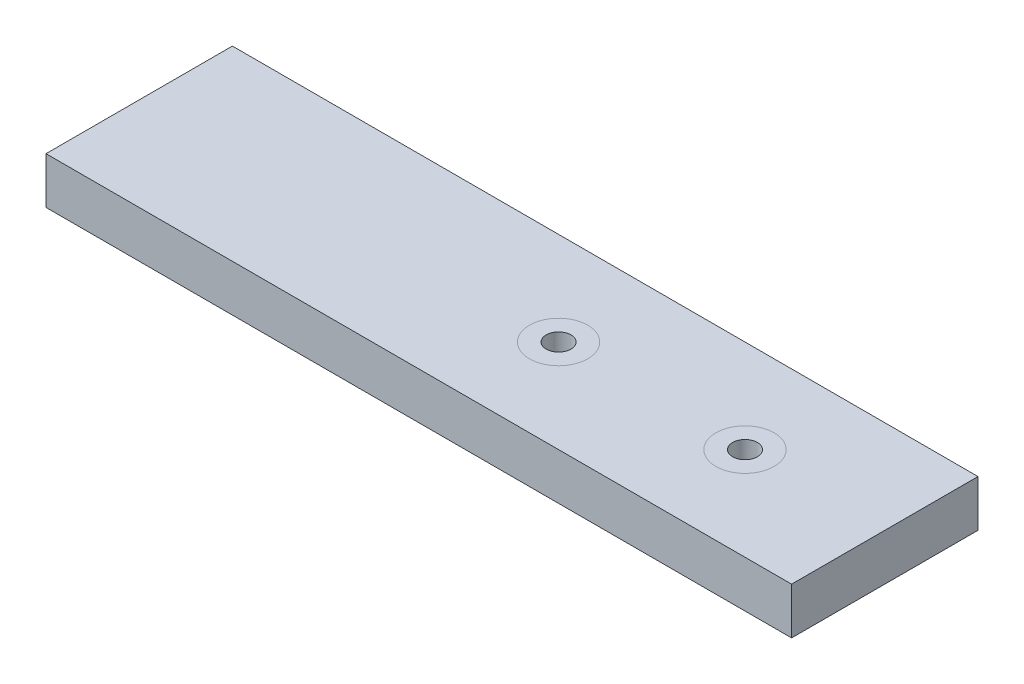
ISO-10303-21;
HEADER;
FILE_DESCRIPTION(('STEP AP214'),'2;1');
FILE_NAME('part.step','',(''),(''),'','','');
FILE_SCHEMA(('AUTOMOTIVE_DESIGN { 1 0 10303 214 1 1 1 1 }'));
ENDSEC;
DATA;
#1=APPLICATION_CONTEXT('core data for automotive mechanical design processes');
#2=APPLICATION_PROTOCOL_DEFINITION('international standard','automotive_design',2000,#1);
#3=PRODUCT_CONTEXT('',#1,'mechanical');
#4=PRODUCT('Part','Part','',(#3));
#5=PRODUCT_RELATED_PRODUCT_CATEGORY('part','',(#4));
#6=PRODUCT_DEFINITION_FORMATION('','',#4);
#7=PRODUCT_DEFINITION_CONTEXT('part definition',#1,'design');
#8=PRODUCT_DEFINITION('design','',#6,#7);
#9=PRODUCT_DEFINITION_SHAPE('','',#8);
#10=(LENGTH_UNIT() NAMED_UNIT(*) SI_UNIT(.MILLI.,.METRE.));
#11=(NAMED_UNIT(*) PLANE_ANGLE_UNIT() SI_UNIT($,.RADIAN.));
#12=(NAMED_UNIT(*) SI_UNIT($,.STERADIAN.) SOLID_ANGLE_UNIT());
#13=UNCERTAINTY_MEASURE_WITH_UNIT(LENGTH_MEASURE(1.E-05),#10,'distance_accuracy_value','');
#14=(GEOMETRIC_REPRESENTATION_CONTEXT(3) GLOBAL_UNCERTAINTY_ASSIGNED_CONTEXT((#13)) GLOBAL_UNIT_ASSIGNED_CONTEXT((#10,
#11,#12)) REPRESENTATION_CONTEXT('',''));
#15=CARTESIAN_POINT('',(0.,0.,0.));
#16=DIRECTION('',(0.,0.,1.));
#17=DIRECTION('',(1.,0.,0.));
#18=AXIS2_PLACEMENT_3D('',#15,#16,#17);
#19=CARTESIAN_POINT('',(0.,0.,-25.4));
#20=DIRECTION('',(0.,-1.,0.));
#21=DIRECTION('',(0.,0.,-1.));
#22=AXIS2_PLACEMENT_3D('',#19,#20,#21);
#23=PLANE('',#22);
#24=CARTESIAN_POINT('',(114.3,0.,0.));
#25=DIRECTION('',(0.,-1.,0.));
#26=DIRECTION('',(0.,0.,-1.));
#27=AXIS2_PLACEMENT_3D('',#24,#25,#26);
#28=CIRCLE('',#27,7.93749999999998);
#29=CARTESIAN_POINT('',(114.3,0.,-7.93749999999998));
#30=VERTEX_POINT('',#29);
#31=EDGE_CURVE('E117',#30,#30,#28,.F.);
#32=ORIENTED_EDGE('',*,*,#31,.T.);
#33=EDGE_LOOP('',(#32));
#34=FACE_BOUND('',#33,.T.);
#35=DIRECTION('',(0.,0.,1.));
#36=VECTOR('',#35,1.);
#37=CARTESIAN_POINT('',(0.,0.,25.4));
#38=LINE('',#37,#36);
#39=CARTESIAN_POINT('',(0.,0.,-25.4));
#40=VERTEX_POINT('',#39);
#41=CARTESIAN_POINT('',(0.,0.,25.4));
#42=VERTEX_POINT('',#41);
#43=EDGE_CURVE('E103',#40,#42,#38,.T.);
#44=ORIENTED_EDGE('',*,*,#43,.F.);
#45=DIRECTION('',(-1.,0.,0.));
#46=VECTOR('',#45,1.);
#47=CARTESIAN_POINT('',(0.,0.,-25.4));
#48=LINE('',#47,#46);
#49=CARTESIAN_POINT('',(203.2,0.,-25.4));
#50=VERTEX_POINT('',#49);
#51=EDGE_CURVE('E74',#50,#40,#48,.T.);
#52=ORIENTED_EDGE('',*,*,#51,.F.);
#53=DIRECTION('',(0.,0.,-1.));
#54=VECTOR('',#53,1.);
#55=CARTESIAN_POINT('',(203.2,0.,25.4));
#56=LINE('',#55,#54);
#57=CARTESIAN_POINT('',(203.2,0.,25.4));
#58=VERTEX_POINT('',#57);
#59=EDGE_CURVE('E68',#58,#50,#56,.T.);
#60=ORIENTED_EDGE('',*,*,#59,.F.);
#61=DIRECTION('',(1.,0.,0.));
#62=VECTOR('',#61,1.);
#63=CARTESIAN_POINT('',(0.,0.,25.4));
#64=LINE('',#63,#62);
#65=EDGE_CURVE('E93',#42,#58,#64,.T.);
#66=ORIENTED_EDGE('',*,*,#65,.F.);
#67=EDGE_LOOP('',(#44,#52,#60,#66));
#68=FACE_BOUND('',#67,.T.);
#69=CARTESIAN_POINT('',(165.1,0.,0.));
#70=DIRECTION('',(0.,-1.,0.));
#71=DIRECTION('',(0.,0.,-1.));
#72=AXIS2_PLACEMENT_3D('',#69,#70,#71);
#73=CIRCLE('',#72,7.93749999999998);
#74=CARTESIAN_POINT('',(165.1,0.,-7.93749999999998));
#75=VERTEX_POINT('',#74);
#76=EDGE_CURVE('E11',#75,#75,#73,.F.);
#77=ORIENTED_EDGE('',*,*,#76,.T.);
#78=EDGE_LOOP('',(#77));
#79=FACE_BOUND('',#78,.T.);
#80=ADVANCED_FACE('F33',(#34,#68,#79),#23,.T.);
#81=CARTESIAN_POINT('',(0.,12.7,-25.4));
#82=DIRECTION('',(0.,-1.,0.));
#83=DIRECTION('',(0.,0.,-1.));
#84=AXIS2_PLACEMENT_3D('',#81,#82,#83);
#85=PLANE('',#84);
#86=CARTESIAN_POINT('',(114.3,12.7,0.));
#87=DIRECTION('',(0.,-1.,0.));
#88=DIRECTION('',(0.,0.,-1.));
#89=AXIS2_PLACEMENT_3D('',#86,#87,#88);
#90=CIRCLE('',#89,7.93749999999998);
#91=CARTESIAN_POINT('',(114.3,12.7,-7.93749999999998));
#92=VERTEX_POINT('',#91);
#93=EDGE_CURVE('E113',#92,#92,#90,.F.);
#94=ORIENTED_EDGE('',*,*,#93,.F.);
#95=EDGE_LOOP('',(#94));
#96=FACE_BOUND('',#95,.T.);
#97=DIRECTION('',(0.,0.,1.));
#98=VECTOR('',#97,1.);
#99=CARTESIAN_POINT('',(0.,12.7,25.4));
#100=LINE('',#99,#98);
#101=CARTESIAN_POINT('',(0.,12.7,-25.4));
#102=VERTEX_POINT('',#101);
#103=CARTESIAN_POINT('',(0.,12.7,25.4));
#104=VERTEX_POINT('',#103);
#105=EDGE_CURVE('E88',#102,#104,#100,.T.);
#106=ORIENTED_EDGE('',*,*,#105,.T.);
#107=DIRECTION('',(1.,0.,0.));
#108=VECTOR('',#107,1.);
#109=CARTESIAN_POINT('',(0.,12.7,25.4));
#110=LINE('',#109,#108);
#111=CARTESIAN_POINT('',(203.2,12.7,25.4));
#112=VERTEX_POINT('',#111);
#113=EDGE_CURVE('E82',#104,#112,#110,.T.);
#114=ORIENTED_EDGE('',*,*,#113,.T.);
#115=DIRECTION('',(0.,0.,-1.));
#116=VECTOR('',#115,1.);
#117=CARTESIAN_POINT('',(203.2,12.7,25.4));
#118=LINE('',#117,#116);
#119=CARTESIAN_POINT('',(203.2,12.7,-25.4));
#120=VERTEX_POINT('',#119);
#121=EDGE_CURVE('E86',#112,#120,#118,.T.);
#122=ORIENTED_EDGE('',*,*,#121,.T.);
#123=DIRECTION('',(-1.,0.,0.));
#124=VECTOR('',#123,1.);
#125=CARTESIAN_POINT('',(0.,12.7,-25.4));
#126=LINE('',#125,#124);
#127=EDGE_CURVE('E51',#120,#102,#126,.T.);
#128=ORIENTED_EDGE('',*,*,#127,.T.);
#129=EDGE_LOOP('',(#106,#114,#122,#128));
#130=FACE_BOUND('',#129,.T.);
#131=CARTESIAN_POINT('',(165.1,12.7,0.));
#132=DIRECTION('',(0.,-1.,0.));
#133=DIRECTION('',(0.,0.,-1.));
#134=AXIS2_PLACEMENT_3D('',#131,#132,#133);
#135=CIRCLE('',#134,7.93749999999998);
#136=CARTESIAN_POINT('',(165.1,12.7,-7.93749999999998));
#137=VERTEX_POINT('',#136);
#138=EDGE_CURVE('E43',#137,#137,#135,.F.);
#139=ORIENTED_EDGE('',*,*,#138,.F.);
#140=EDGE_LOOP('',(#139));
#141=FACE_BOUND('',#140,.T.);
#142=ADVANCED_FACE('F83',(#96,#130,#141),#85,.F.);
#143=ORIENTED_EDGE('',*,*,#76,.F.);
#144=EDGE_LOOP('',(#143));
#145=FACE_BOUND('',#144,.T.);
#146=CARTESIAN_POINT('',(165.1,0.,0.));
#147=DIRECTION('',(0.,1.,0.));
#148=DIRECTION('',(0.,0.,1.));
#149=AXIS2_PLACEMENT_3D('',#146,#147,#148);
#150=CIRCLE('',#149,3.3782);
#151=CARTESIAN_POINT('',(165.1,0.,3.3782));
#152=VERTEX_POINT('',#151);
#153=EDGE_CURVE('E167',#152,#152,#150,.T.);
#154=ORIENTED_EDGE('',*,*,#153,.T.);
#155=EDGE_LOOP('',(#154));
#156=FACE_BOUND('',#155,.T.);
#157=ADVANCED_FACE('F129',(#145,#156),#23,.T.);
#158=ORIENTED_EDGE('',*,*,#138,.T.);
#159=EDGE_LOOP('',(#158));
#160=FACE_BOUND('',#159,.T.);
#161=CARTESIAN_POINT('',(165.1,12.7,0.));
#162=DIRECTION('',(0.,1.,0.));
#163=DIRECTION('',(0.,0.,1.));
#164=AXIS2_PLACEMENT_3D('',#161,#162,#163);
#165=CIRCLE('',#164,3.3782);
#166=CARTESIAN_POINT('',(165.1,12.7,3.3782));
#167=VERTEX_POINT('',#166);
#168=EDGE_CURVE('E162',#167,#167,#165,.T.);
#169=ORIENTED_EDGE('',*,*,#168,.F.);
#170=EDGE_LOOP('',(#169));
#171=FACE_BOUND('',#170,.T.);
#172=ADVANCED_FACE('F126',(#160,#171),#85,.F.);
#173=ORIENTED_EDGE('',*,*,#31,.F.);
#174=EDGE_LOOP('',(#173));
#175=FACE_BOUND('',#174,.T.);
#176=CARTESIAN_POINT('',(114.3,0.,0.));
#177=DIRECTION('',(0.,1.,0.));
#178=DIRECTION('',(0.,0.,1.));
#179=AXIS2_PLACEMENT_3D('',#176,#177,#178);
#180=CIRCLE('',#179,3.3782);
#181=CARTESIAN_POINT('',(114.3,0.,3.3782));
#182=VERTEX_POINT('',#181);
#183=EDGE_CURVE('E159',#182,#182,#180,.T.);
#184=ORIENTED_EDGE('',*,*,#183,.T.);
#185=EDGE_LOOP('',(#184));
#186=FACE_BOUND('',#185,.T.);
#187=ADVANCED_FACE('F139',(#175,#186),#23,.T.);
#188=CARTESIAN_POINT('',(0.,12.7,25.4));
#189=DIRECTION('',(1.,0.,0.));
#190=DIRECTION('',(0.,0.,-1.));
#191=AXIS2_PLACEMENT_3D('',#188,#189,#190);
#192=PLANE('',#191);
#193=ORIENTED_EDGE('',*,*,#43,.T.);
#194=DIRECTION('',(0.,-1.,0.));
#195=VECTOR('',#194,1.);
#196=CARTESIAN_POINT('',(0.,12.7,25.4));
#197=LINE('',#196,#195);
#198=EDGE_CURVE('E94',#104,#42,#197,.T.);
#199=ORIENTED_EDGE('',*,*,#198,.F.);
#200=ORIENTED_EDGE('',*,*,#105,.F.);
#201=DIRECTION('',(0.,-1.,0.));
#202=VECTOR('',#201,1.);
#203=CARTESIAN_POINT('',(0.,12.7,-25.4));
#204=LINE('',#203,#202);
#205=EDGE_CURVE('E99',#102,#40,#204,.T.);
#206=ORIENTED_EDGE('',*,*,#205,.T.);
#207=EDGE_LOOP('',(#193,#199,#200,#206));
#208=FACE_BOUND('',#207,.T.);
#209=ADVANCED_FACE('F35',(#208),#192,.F.);
#210=CARTESIAN_POINT('',(0.,12.7,25.4));
#211=DIRECTION('',(0.,0.,-1.));
#212=DIRECTION('',(-1.,0.,0.));
#213=AXIS2_PLACEMENT_3D('',#210,#211,#212);
#214=PLANE('',#213);
#215=ORIENTED_EDGE('',*,*,#65,.T.);
#216=DIRECTION('',(0.,-1.,0.));
#217=VECTOR('',#216,1.);
#218=CARTESIAN_POINT('',(203.2,12.7,25.4));
#219=LINE('',#218,#217);
#220=EDGE_CURVE('E91',#112,#58,#219,.T.);
#221=ORIENTED_EDGE('',*,*,#220,.F.);
#222=ORIENTED_EDGE('',*,*,#113,.F.);
#223=ORIENTED_EDGE('',*,*,#198,.T.);
#224=EDGE_LOOP('',(#215,#221,#222,#223));
#225=FACE_BOUND('',#224,.T.);
#226=ADVANCED_FACE('F92',(#225),#214,.F.);
#227=CARTESIAN_POINT('',(203.2,12.7,25.4));
#228=DIRECTION('',(-1.,0.,0.));
#229=DIRECTION('',(0.,0.,1.));
#230=AXIS2_PLACEMENT_3D('',#227,#228,#229);
#231=PLANE('',#230);
#232=ORIENTED_EDGE('',*,*,#59,.T.);
#233=DIRECTION('',(0.,-1.,0.));
#234=VECTOR('',#233,1.);
#235=CARTESIAN_POINT('',(203.2,12.7,-25.4));
#236=LINE('',#235,#234);
#237=EDGE_CURVE('E95',#120,#50,#236,.T.);
#238=ORIENTED_EDGE('',*,*,#237,.F.);
#239=ORIENTED_EDGE('',*,*,#121,.F.);
#240=ORIENTED_EDGE('',*,*,#220,.T.);
#241=EDGE_LOOP('',(#232,#238,#239,#240));
#242=FACE_BOUND('',#241,.T.);
#243=ADVANCED_FACE('F97',(#242),#231,.F.);
#244=CARTESIAN_POINT('',(0.,12.7,-25.4));
#245=DIRECTION('',(0.,0.,1.));
#246=DIRECTION('',(1.,0.,0.));
#247=AXIS2_PLACEMENT_3D('',#244,#245,#246);
#248=PLANE('',#247);
#249=ORIENTED_EDGE('',*,*,#51,.T.);
#250=ORIENTED_EDGE('',*,*,#205,.F.);
#251=ORIENTED_EDGE('',*,*,#127,.F.);
#252=ORIENTED_EDGE('',*,*,#237,.T.);
#253=EDGE_LOOP('',(#249,#250,#251,#252));
#254=FACE_BOUND('',#253,.T.);
#255=ADVANCED_FACE('F146',(#254),#248,.F.);
#256=ORIENTED_EDGE('',*,*,#93,.T.);
#257=EDGE_LOOP('',(#256));
#258=FACE_BOUND('',#257,.T.);
#259=CARTESIAN_POINT('',(114.3,12.7,0.));
#260=DIRECTION('',(0.,1.,0.));
#261=DIRECTION('',(0.,0.,1.));
#262=AXIS2_PLACEMENT_3D('',#259,#260,#261);
#263=CIRCLE('',#262,3.37819999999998);
#264=CARTESIAN_POINT('',(114.3,12.7,3.37819999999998));
#265=VERTEX_POINT('',#264);
#266=EDGE_CURVE('E106',#265,#265,#263,.T.);
#267=ORIENTED_EDGE('',*,*,#266,.F.);
#268=EDGE_LOOP('',(#267));
#269=FACE_BOUND('',#268,.T.);
#270=ADVANCED_FACE('F132',(#258,#269),#85,.F.);
#271=CARTESIAN_POINT('',(114.3,12.7,0.));
#272=DIRECTION('',(0.,1.,0.));
#273=DIRECTION('',(0.,0.,1.));
#274=AXIS2_PLACEMENT_3D('',#271,#272,#273);
#275=CYLINDRICAL_SURFACE('',#274,3.37819999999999);
#276=ORIENTED_EDGE('',*,*,#183,.F.);
#277=EDGE_LOOP('',(#276));
#278=FACE_BOUND('',#277,.T.);
#279=ORIENTED_EDGE('',*,*,#266,.T.);
#280=EDGE_LOOP('',(#279));
#281=FACE_BOUND('',#280,.T.);
#282=ADVANCED_FACE('F145',(#278,#281),#275,.F.);
#283=CARTESIAN_POINT('',(165.1,12.7,0.));
#284=DIRECTION('',(0.,1.,0.));
#285=DIRECTION('',(0.,0.,1.));
#286=AXIS2_PLACEMENT_3D('',#283,#284,#285);
#287=CYLINDRICAL_SURFACE('',#286,3.3782);
#288=ORIENTED_EDGE('',*,*,#153,.F.);
#289=EDGE_LOOP('',(#288));
#290=FACE_BOUND('',#289,.T.);
#291=ORIENTED_EDGE('',*,*,#168,.T.);
#292=EDGE_LOOP('',(#291));
#293=FACE_BOUND('',#292,.T.);
#294=ADVANCED_FACE('F152',(#290,#293),#287,.F.);
#295=CLOSED_SHELL('',(#80,#142,#157,#172,#187,#209,#226,#243,#255,#270,#282,#294));
#296=MANIFOLD_SOLID_BREP('B2',#295);
#297=ADVANCED_BREP_SHAPE_REPRESENTATION('',(#18,#296),#14);
#298=SHAPE_DEFINITION_REPRESENTATION(#9,#297);
ENDSEC;
END-ISO-10303-21;
